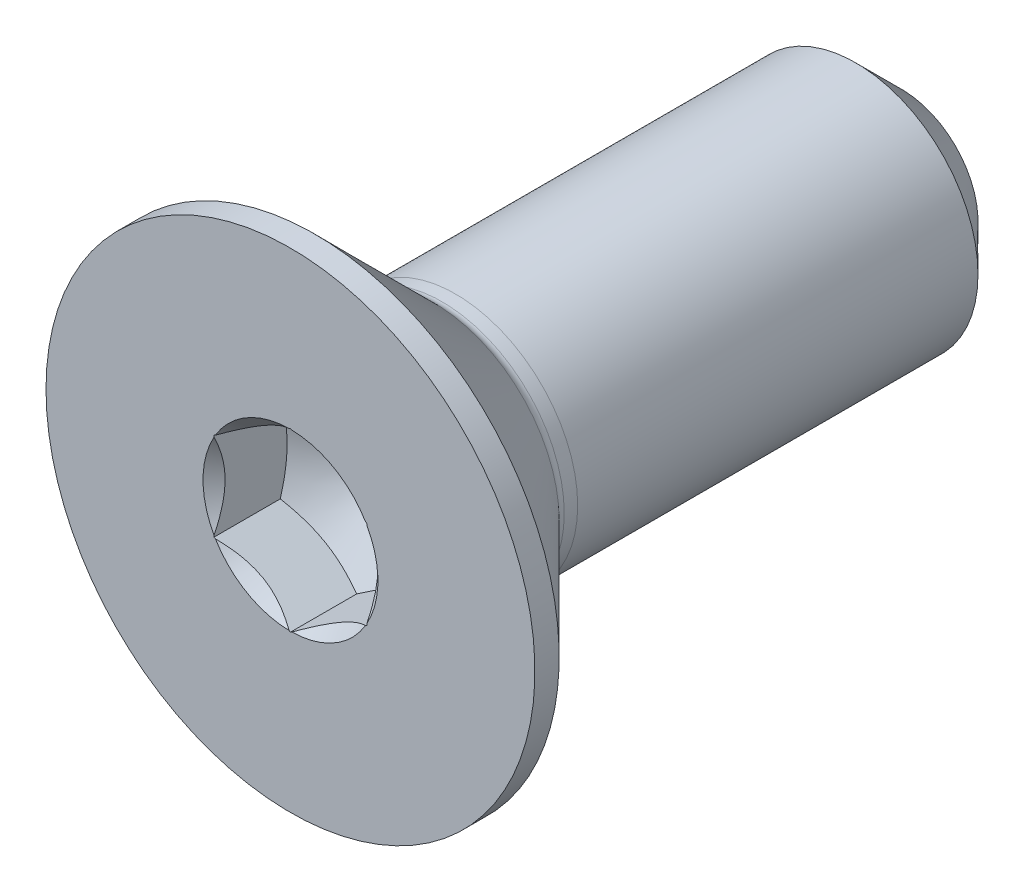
from build123d import *

# Parameters (mm, degrees)
SKETCH_1_3_W    = 14.6
SKETCH_1_3_H    = 4
EXTRUDE_1_REACH = 24.978
SKETCH_2_R      = 3.386751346


with BuildPart() as part:
    # Sketch 1 → Revolve 1 (revolve)
    with BuildSketch(Plane(origin=(0, 0, 0), x_dir=(0, 0, -1), z_dir=(1, 0, 0)), mode=Mode.PRIVATE) as revolve_1_sk:
        with BuildLine():
            Line((0, 8), (0, 2.886751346))
            Line((0, 2.886751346), (2.166666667, 2.886751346))
            Line((2.166666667, 2.886751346), (3.833333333, 0))
            Line((3.833333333, 0), (5.4, 0))
            Line((5.4, 0), (5.4, 4))
            Line((5.4, 4), (4.96, 4))
            ThreePointArc((4.96, 4), (4.806926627, 4.030448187), (4.677157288, 4.117157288))
            Line((4.677157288, 4.117157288), (0.794314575, 8))
            Line((0.794314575, 8), (0, 8))
        make_face()
    revolve(revolve_1_sk.sketch.rotate(Axis((0, 0, 0), (0, 0, 1)), 90), axis=Axis((0, 0, 0), (0, 0, 1)))

    # Extrude 1: up to this cone (the profile starts inside it)
    extrude_1_end = Plane(origin=(0, 0, 0), z_dir=(0, 0, 1)).offset(-3.833332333) * Cone(1.732e-06, 62.268718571, 35.950860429, align=(Align.CENTER, Align.CENTER, Align.MIN), mode=Mode.PRIVATE)
    # Sketch 2 → Extrude 1 (add, up to the surface)
    with BuildSketch(Plane.XY, mode=Mode.PRIVATE) as extrude_1_sk1:
        Circle(SKETCH_2_R)
        Polygon((0, -2.886751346), (2.5, -1.443375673), (2.5, 1.443375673), (0, 2.886751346), (-2.5, 1.443375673), (-2.5, -1.443375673), align=None, mode=Mode.SUBTRACT)
    extrude_1_tool1 = extrude(extrude_1_sk1.sketch, amount=-EXTRUDE_1_REACH, mode=Mode.PRIVATE) & extrude_1_end
    add(extrude_1_tool1.solids().sort_by_distance((-3.29096, 0, 0))[0])


with BuildPart() as body_2:
    # Sketch 1_3 → Revolve 2 (revolve)
    with BuildSketch(Plane(origin=(0, 0, 0), x_dir=(0, 0, -1), z_dir=(1, 0, 0)), mode=Mode.PRIVATE) as revolve_2_sk:
        with Locations((12.7, 2)):
            Rectangle(SKETCH_1_3_W, SKETCH_1_3_H)
    revolve(revolve_2_sk.sketch.rotate(Axis((0, 0, 0), (0, 0, 1)), 90), axis=Axis((0, 0, 0), (0, 0, 1)))


with BuildPart() as cut_revolve_1_tool:
    # Sketch 3 → Cut-Revolve 1 (revolve)
    with BuildSketch(Plane(origin=(0, 0, 0), x_dir=(0, 0, -1), z_dir=(1, 0, 0))):
        Polygon((0, 0), (0, 2.8615), (2.8615, 0), align=None)
        Polygon((20, 4), (18.5, 4), (20, 2.5), align=None)
    revolve(axis=Axis((0, 0, 0), (0, 0, 1)))


with BuildPart() as part_1:
    add(part.part)

    # Cut-Revolve 1: cut by cut_revolve_1_tool
    add(cut_revolve_1_tool.part, mode=Mode.SUBTRACT)


with BuildPart() as body_2_1:
    add(body_2.part)

    # Cut-Revolve 1: cut by cut_revolve_1_tool
    add(cut_revolve_1_tool.part, mode=Mode.SUBTRACT)


solid = Compound([part_1.part, body_2_1.part])
